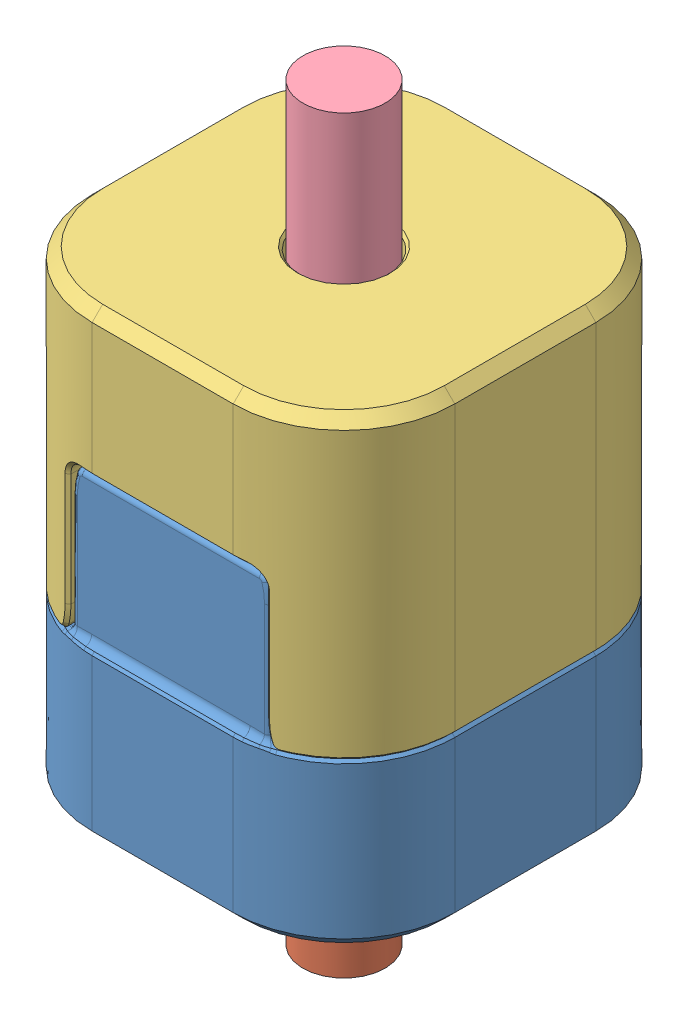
SolidWorks assembly TL137X137.SLDASM, configuration Default (file format 13000). Lengths in mm.
Overall size (34.93 72.15 34.93).
6 component instances, 4 part files, 0 mates.
Components (placement in the parent):
- TL137X137 MALE HALF-1: TL137X137 MALE HALF.SLDASM [Default] at origin size (34.93 43.62 34.93)
  - TL137X137-M-1: TL137X137-M.SLDPRT [Default] at origin size (34.93 29.84 34.93)
  - SHCS31-18L1.37-1: SHCS31-18L1.37.sldprt [SHCS31-18L.75] at (0 5.2705 0) x (0.968882 0 -0.247523) z (0 -1 0) size (11.89 11.89 42.85)
- TL137X137 FEMALE HALF-1: TL137X137 FEMALE HALF.SLDASM [Default] at origin size (34.93 42.49 34.93)
  - TL137X137-F-1: TL137X137-F.SLDPRT [Default] at origin size (34.93 28.58 34.93)
  - SHCS31-18L.75-1: SHCS31-18L.75.sldprt [SHCS31-18L.75] at (0 23.4442 0) x (0.954024 0 -0.299732) z (0 1 0) size (11.89 11.89 26.97)
